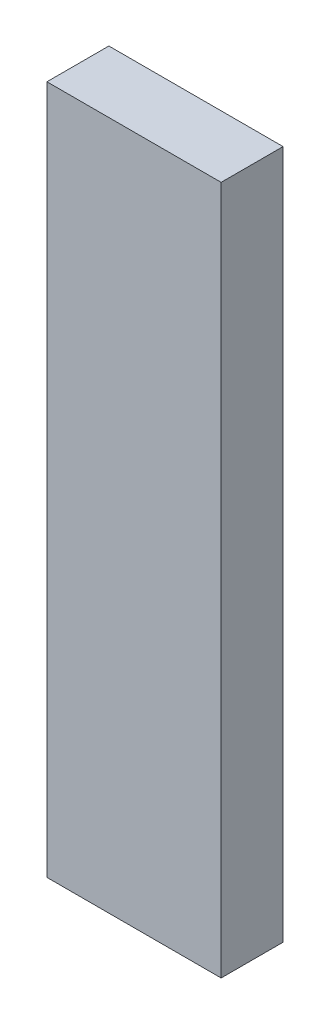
ISO-10303-21;
HEADER;
FILE_DESCRIPTION(('STEP AP214'),'2;1');
FILE_NAME('part.step','',(''),(''),'','','');
FILE_SCHEMA(('AUTOMOTIVE_DESIGN { 1 0 10303 214 1 1 1 1 }'));
ENDSEC;
DATA;
#1=APPLICATION_CONTEXT('core data for automotive mechanical design processes');
#2=APPLICATION_PROTOCOL_DEFINITION('international standard','automotive_design',2000,#1);
#3=PRODUCT_CONTEXT('',#1,'mechanical');
#4=PRODUCT('Part','Part','',(#3));
#5=PRODUCT_RELATED_PRODUCT_CATEGORY('part','',(#4));
#6=PRODUCT_DEFINITION_FORMATION('','',#4);
#7=PRODUCT_DEFINITION_CONTEXT('part definition',#1,'design');
#8=PRODUCT_DEFINITION('design','',#6,#7);
#9=PRODUCT_DEFINITION_SHAPE('','',#8);
#10=(LENGTH_UNIT() NAMED_UNIT(*) SI_UNIT(.MILLI.,.METRE.));
#11=(NAMED_UNIT(*) PLANE_ANGLE_UNIT() SI_UNIT($,.RADIAN.));
#12=(NAMED_UNIT(*) SI_UNIT($,.STERADIAN.) SOLID_ANGLE_UNIT());
#13=UNCERTAINTY_MEASURE_WITH_UNIT(LENGTH_MEASURE(1.E-05),#10,'distance_accuracy_value','');
#14=(GEOMETRIC_REPRESENTATION_CONTEXT(3) GLOBAL_UNCERTAINTY_ASSIGNED_CONTEXT((#13)) GLOBAL_UNIT_ASSIGNED_CONTEXT((#10,
#11,#12)) REPRESENTATION_CONTEXT('',''));
#15=CARTESIAN_POINT('',(0.,0.,0.));
#16=DIRECTION('',(0.,0.,1.));
#17=DIRECTION('',(1.,0.,0.));
#18=AXIS2_PLACEMENT_3D('',#15,#16,#17);
#19=CARTESIAN_POINT('',(0.,0.,8.));
#20=DIRECTION('',(1.,0.,0.));
#21=DIRECTION('',(0.,0.,-1.));
#22=AXIS2_PLACEMENT_3D('',#19,#20,#21);
#23=PLANE('',#22);
#24=DIRECTION('',(0.,-1.,0.));
#25=VECTOR('',#24,1.);
#26=CARTESIAN_POINT('',(0.,0.,0.));
#27=LINE('',#26,#25);
#28=CARTESIAN_POINT('',(0.,89.,0.));
#29=VERTEX_POINT('',#28);
#30=CARTESIAN_POINT('',(0.,0.,0.));
#31=VERTEX_POINT('',#30);
#32=EDGE_CURVE('E94',#29,#31,#27,.T.);
#33=ORIENTED_EDGE('',*,*,#32,.T.);
#34=DIRECTION('',(0.,0.,-1.));
#35=VECTOR('',#34,1.);
#36=CARTESIAN_POINT('',(0.,0.,8.));
#37=LINE('',#36,#35);
#38=CARTESIAN_POINT('',(0.,0.,8.));
#39=VERTEX_POINT('',#38);
#40=EDGE_CURVE('E11',#39,#31,#37,.T.);
#41=ORIENTED_EDGE('',*,*,#40,.F.);
#42=DIRECTION('',(0.,-1.,0.));
#43=VECTOR('',#42,1.);
#44=CARTESIAN_POINT('',(0.,0.,8.));
#45=LINE('',#44,#43);
#46=CARTESIAN_POINT('',(0.,89.,8.));
#47=VERTEX_POINT('',#46);
#48=EDGE_CURVE('E82',#47,#39,#45,.T.);
#49=ORIENTED_EDGE('',*,*,#48,.F.);
#50=DIRECTION('',(0.,0.,-1.));
#51=VECTOR('',#50,1.);
#52=CARTESIAN_POINT('',(0.,89.,8.));
#53=LINE('',#52,#51);
#54=EDGE_CURVE('E90',#47,#29,#53,.T.);
#55=ORIENTED_EDGE('',*,*,#54,.T.);
#56=EDGE_LOOP('',(#33,#41,#49,#55));
#57=FACE_BOUND('',#56,.T.);
#58=ADVANCED_FACE('F31',(#57),#23,.F.);
#59=CARTESIAN_POINT('',(0.,0.,8.));
#60=DIRECTION('',(0.,1.,0.));
#61=DIRECTION('',(0.,0.,1.));
#62=AXIS2_PLACEMENT_3D('',#59,#60,#61);
#63=PLANE('',#62);
#64=DIRECTION('',(1.,0.,0.));
#65=VECTOR('',#64,1.);
#66=CARTESIAN_POINT('',(0.,0.,0.));
#67=LINE('',#66,#65);
#68=CARTESIAN_POINT('',(22.5,0.,0.));
#69=VERTEX_POINT('',#68);
#70=EDGE_CURVE('E86',#31,#69,#67,.T.);
#71=ORIENTED_EDGE('',*,*,#70,.T.);
#72=DIRECTION('',(0.,0.,-1.));
#73=VECTOR('',#72,1.);
#74=CARTESIAN_POINT('',(22.5,0.,8.));
#75=LINE('',#74,#73);
#76=CARTESIAN_POINT('',(22.5,0.,8.));
#77=VERTEX_POINT('',#76);
#78=EDGE_CURVE('E39',#77,#69,#75,.T.);
#79=ORIENTED_EDGE('',*,*,#78,.F.);
#80=DIRECTION('',(1.,0.,0.));
#81=VECTOR('',#80,1.);
#82=CARTESIAN_POINT('',(0.,0.,8.));
#83=LINE('',#82,#81);
#84=EDGE_CURVE('E77',#39,#77,#83,.T.);
#85=ORIENTED_EDGE('',*,*,#84,.F.);
#86=ORIENTED_EDGE('',*,*,#40,.T.);
#87=EDGE_LOOP('',(#71,#79,#85,#86));
#88=FACE_BOUND('',#87,.T.);
#89=ADVANCED_FACE('F85',(#88),#63,.F.);
#90=CARTESIAN_POINT('',(22.5,0.,8.));
#91=DIRECTION('',(-1.,0.,0.));
#92=DIRECTION('',(0.,0.,1.));
#93=AXIS2_PLACEMENT_3D('',#90,#91,#92);
#94=PLANE('',#93);
#95=DIRECTION('',(0.,1.,0.));
#96=VECTOR('',#95,1.);
#97=CARTESIAN_POINT('',(22.5,0.,0.));
#98=LINE('',#97,#96);
#99=CARTESIAN_POINT('',(22.5,89.,0.));
#100=VERTEX_POINT('',#99);
#101=EDGE_CURVE('E64',#69,#100,#98,.T.);
#102=ORIENTED_EDGE('',*,*,#101,.T.);
#103=DIRECTION('',(0.,0.,-1.));
#104=VECTOR('',#103,1.);
#105=CARTESIAN_POINT('',(22.5,89.,8.));
#106=LINE('',#105,#104);
#107=CARTESIAN_POINT('',(22.5,89.,8.));
#108=VERTEX_POINT('',#107);
#109=EDGE_CURVE('E87',#108,#100,#106,.T.);
#110=ORIENTED_EDGE('',*,*,#109,.F.);
#111=DIRECTION('',(0.,1.,0.));
#112=VECTOR('',#111,1.);
#113=CARTESIAN_POINT('',(22.5,0.,8.));
#114=LINE('',#113,#112);
#115=EDGE_CURVE('E80',#77,#108,#114,.T.);
#116=ORIENTED_EDGE('',*,*,#115,.F.);
#117=ORIENTED_EDGE('',*,*,#78,.T.);
#118=EDGE_LOOP('',(#102,#110,#116,#117));
#119=FACE_BOUND('',#118,.T.);
#120=ADVANCED_FACE('F88',(#119),#94,.F.);
#121=CARTESIAN_POINT('',(0.,89.,8.));
#122=DIRECTION('',(0.,-1.,0.));
#123=DIRECTION('',(0.,0.,-1.));
#124=AXIS2_PLACEMENT_3D('',#121,#122,#123);
#125=PLANE('',#124);
#126=DIRECTION('',(-1.,0.,0.));
#127=VECTOR('',#126,1.);
#128=CARTESIAN_POINT('',(0.,89.,0.));
#129=LINE('',#128,#127);
#130=EDGE_CURVE('E70',#100,#29,#129,.T.);
#131=ORIENTED_EDGE('',*,*,#130,.T.);
#132=ORIENTED_EDGE('',*,*,#54,.F.);
#133=DIRECTION('',(-1.,0.,0.));
#134=VECTOR('',#133,1.);
#135=CARTESIAN_POINT('',(0.,89.,8.));
#136=LINE('',#135,#134);
#137=EDGE_CURVE('E47',#108,#47,#136,.T.);
#138=ORIENTED_EDGE('',*,*,#137,.F.);
#139=ORIENTED_EDGE('',*,*,#109,.T.);
#140=EDGE_LOOP('',(#131,#132,#138,#139));
#141=FACE_BOUND('',#140,.T.);
#142=ADVANCED_FACE('F101',(#141),#125,.F.);
#143=CARTESIAN_POINT('',(0.,89.,8.));
#144=DIRECTION('',(0.,0.,-1.));
#145=DIRECTION('',(-1.,0.,0.));
#146=AXIS2_PLACEMENT_3D('',#143,#144,#145);
#147=PLANE('',#146);
#148=ORIENTED_EDGE('',*,*,#48,.T.);
#149=ORIENTED_EDGE('',*,*,#84,.T.);
#150=ORIENTED_EDGE('',*,*,#115,.T.);
#151=ORIENTED_EDGE('',*,*,#137,.T.);
#152=EDGE_LOOP('',(#148,#149,#150,#151));
#153=FACE_BOUND('',#152,.T.);
#154=ADVANCED_FACE('F78',(#153),#147,.F.);
#155=CARTESIAN_POINT('',(0.,89.,0.));
#156=DIRECTION('',(0.,0.,-1.));
#157=DIRECTION('',(-1.,0.,0.));
#158=AXIS2_PLACEMENT_3D('',#155,#156,#157);
#159=PLANE('',#158);
#160=ORIENTED_EDGE('',*,*,#32,.F.);
#161=ORIENTED_EDGE('',*,*,#130,.F.);
#162=ORIENTED_EDGE('',*,*,#101,.F.);
#163=ORIENTED_EDGE('',*,*,#70,.F.);
#164=EDGE_LOOP('',(#160,#161,#162,#163));
#165=FACE_BOUND('',#164,.T.);
#166=ADVANCED_FACE('F104',(#165),#159,.T.);
#167=CLOSED_SHELL('',(#58,#89,#120,#142,#154,#166));
#168=MANIFOLD_SOLID_BREP('B2',#167);
#169=ADVANCED_BREP_SHAPE_REPRESENTATION('',(#18,#168),#14);
#170=SHAPE_DEFINITION_REPRESENTATION(#9,#169);
ENDSEC;
END-ISO-10303-21;
